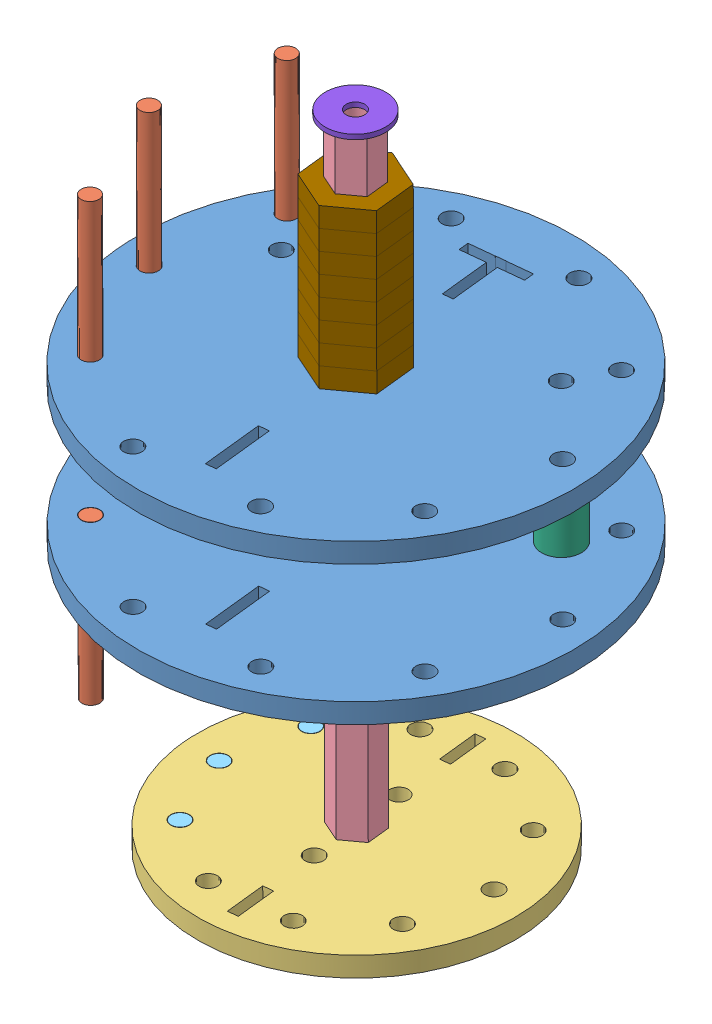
SolidWorks assembly Accumulator.SLDASM, configuration Default (file format 7000). Lengths in mm.
Overall size (76.79 111.93 76.84).
26 component instances, 9 part files, 36 mates.
Components (placement in the parent):
- AccumulatorGear-3: AccumulatorGear.SLDPRT [accum] at (5.3215 -39.4588 28.4724) x (0.104553 -0.002805 0.994515) z (-0.994519 0.00053 0.104555) size (69.85 3.17 69.85)
- AccumulatorGear-4: AccumulatorGear.SLDPRT [accum] at (5.3032 -61.6837 28.4116) x (0.104553 -0.002805 0.994515) z (-0.994519 0.00053 0.104555) size (69.85 3.17 69.85)
- Screw-4-40-1in-1: Screw-4-40-1in.SLDPRT [Default] at (-24.5385 -14.043 31.6833) x (0.998773 -0.000684 -0.049509) z (-0.049507 0.002771 -0.99877) size (2.84 25.4 2.84)
- Screw-4-40-1in-2: Screw-4-40-1in.SLDPRT [Default] at (-20.6782 -13.9965 13.5198) x (0.998773 -0.000684 -0.049509) z (-0.049507 0.002771 -0.99877) size (2.84 25.4 2.84)
- Screw-4-40-1in-3: Screw-4-40-1in.SLDPRT [Default] at (-16.9854 -14.0955 48.6468) x (0.998773 -0.000684 -0.049509) z (-0.049507 0.002771 -0.99877) size (2.84 25.4 2.84)
- Screw-4-40-1in-4: Screw-4-40-1in.SLDPRT [Default] at (-24.575 -58.4928 31.5617) x (0.998773 -0.000684 -0.049509) z (-0.049507 0.002771 -0.99877) size (2.84 25.4 2.84)
- Screw-4-40-1in-5: Screw-4-40-1in.SLDPRT [Default] at (-17.0427 -83.9452 48.4558) x (-0.902967 0.001916 -0.429705) z (0.429708 0.002116 -0.902965) size (2.84 25.4 2.84)
- Screw-4-40-1in-6: Screw-4-40-1in.SLDPRT [Default] at (-20.7147 -58.4463 13.3983) x (0.998773 -0.000684 -0.049509) z (-0.049507 0.002771 -0.99877) size (2.84 25.4 2.84)
- OutputGear-1: OutputGear.SLDPRT [Default] at (5.2689 -103.5935 28.297) x (0.104553 -0.002805 0.994515) z (-0.994519 0.00053 0.104555) size (50.8 3.17 50.8)
- Standoff-4in-1s4-2: Standoff-4in-1s4.SLDPRT [Default] at (5.2689 -103.5935 28.297) x (0.104553 -0.002805 0.994515) z (-0.994519 0.00053 0.104555) size (7.33 101.6 6.35)
- Screw-4-40-0p5in-1: Screw-4-40-0p5in.SLDPRT [Default] at (-14.6072 -113.1079 30.3598) x (1 -0.00082 -0.000001) z (-0.000001 -0.002734 0.999996) size (2.84 12.7 2.84)
- Screw-4-40-0p5in-2: Screw-4-40-0p5in.SLDPRT [Default] at (-9.585 -113.1428 41.6391) x (1 -0.00082 -0.000001) z (-0.000001 -0.002734 0.999996) size (2.84 12.7 2.84)
- Screw-4-40-0p5in-3: Screw-4-40-0p5in.SLDPRT [Default] at (-12.0405 -113.077 18.2826) x (1 -0.00082 -0.000001) z (-0.000001 -0.002734 0.999996) size (2.84 12.7 2.84)
- Standoff-p75in-1s4-1: Standoff-p75in-1s4.SLDPRT [Default] at (24.329 -39.4366 14.6619) x (1 -0.00082 -0.000001) z (-0.00082 -0.999996 -0.002734) size (6.35 6.35 19.05)
- Standoff-p75in-1s4-2: Standoff-p75in-1s4.SLDPRT [Default] at (-16.1425 -39.415 18.9167) x (0.984615 -0.00033 -0.174737) z (-0.00082 -0.999996 -0.002734) size (6.35 6.35 19.05)
- OutputGearCap-1: OutputGearCap.SLDPRT [Default] at (5.2663 -106.7685 28.2884) x (0.104553 -0.002805 0.994515) z (-0.994519 0.00053 0.104555) size (21.59 3.17 21.59)
- Washer-0p38in-1: Washer-0p38in.SLDPRT [Default] at (5.3522 -1.9939 28.5748) x (0.863042 0.000673 -0.505132) z (0.00082 0.999996 0.002734) size (9.65 9.65 0.76)
- Spacer-stack-8-1: Spacer-stack-8.SLDASM [Default] at (-3.9287 -43.7527 21.5045) x (0.104553 -0.002805 0.994515) z (0.00082 0.999996 0.002734) size (13.2 11.43 25.4)
  - Spacer-hex-1s4-1: Spacer-hex-1s4.SLDPRT [Default] at (7.8847 8.4687 7.4956) size (13.2 11.43 3.17)
  - Spacer-hex-1s4-2: Spacer-hex-1s4.SLDPRT [Default] at (7.8847 8.4687 10.6706) size (13.2 11.43 3.17)
  - Spacer-hex-1s4-3: Spacer-hex-1s4.SLDPRT [Default] at (7.8847 8.4687 13.8456) size (13.2 11.43 3.17)
  - Spacer-hex-1s4-4: Spacer-hex-1s4.SLDPRT [Default] at (7.8847 8.4687 17.0206) size (13.2 11.43 3.17)
  - Spacer-hex-1s4-5: Spacer-hex-1s4.SLDPRT [Default] at (7.8847 8.4687 20.1956) size (13.2 11.43 3.17)
  - Spacer-hex-1s4-6: Spacer-hex-1s4.SLDPRT [Default] at (7.8847 8.4687 23.3706) size (13.2 11.43 3.17)
  - Spacer-hex-1s4-7: Spacer-hex-1s4.SLDPRT [Default] at (7.8847 8.4687 26.5456) size (13.2 11.43 3.17)
  - Spacer-hex-1s4-8: Spacer-hex-1s4.SLDPRT [Default] at (7.8847 8.4687 29.7206) size (13.2 11.43 3.17)
Mates (geometry in assembly coordinates):
- Concentric16: concentric anti-aligned: circle of AccumulatorGear-3; circle of Screw-4-40-1in-1
- Coincident36: coincident aligned: plane of AccumulatorGear-3 through (5.3236 -36.9188 28.4793) normal (-0.00082 -0.999996 -0.002734); plane of Screw-4-40-1in-1 through (-24.5573 -36.9029 31.6207) normal (-0.00082 -0.999996 -0.002734)
- Concentric17: concentric anti-aligned: circle of AccumulatorGear-3; circle of Screw-4-40-1in-2
- Coincident37: coincident aligned: plane of AccumulatorGear-3 through (5.3236 -36.9188 28.4793) normal (-0.00082 -0.999996 -0.002734); plane of Screw-4-40-1in-2 through (-20.697 -36.8564 13.4573) normal (-0.00082 -0.999996 -0.002734)
- Concentric18: concentric anti-aligned: circle of AccumulatorGear-3; circle of Screw-4-40-1in-3
- Coincident38: coincident aligned: plane of AccumulatorGear-3 through (5.3236 -36.9188 28.4793) normal (-0.00082 -0.999996 -0.002734); plane of Screw-4-40-1in-3 through (-17.0041 -36.9554 48.5843) normal (-0.00082 -0.999996 -0.002734)
- Concentric19: concentric anti-aligned: circle of AccumulatorGear-4; circle of Screw-4-40-1in-4
- Coincident43: coincident aligned: plane of AccumulatorGear-4 through (5.3079 -55.9687 28.4273) normal (0.00082 0.999996 0.002734); plane of Screw-4-40-1in-4 through (-24.5729 -55.9528 31.5687) normal (0.00082 0.999996 0.002734)
- Concentric20: concentric aligned: circle of AccumulatorGear-4; circle of Screw-4-40-1in-5
- Coincident44: coincident aligned: plane of AccumulatorGear-4 through (5.3079 -55.9687 28.4273) normal (0.00082 0.999996 0.002734); plane of Screw-4-40-1in-5 through (-17.0197 -56.0054 48.5322) normal (0.00082 0.999996 0.002734)
- Concentric21: concentric anti-aligned: circle of AccumulatorGear-4; circle of Screw-4-40-1in-6
- Coincident45: coincident aligned: plane of AccumulatorGear-4 through (5.3079 -55.9687 28.4273) normal (0.00082 0.999996 0.002734); plane of Screw-4-40-1in-6 through (-20.7126 -55.9063 13.4052) normal (0.00082 0.999996 0.002734)
- Coincident55: coincident aligned: line of OutputGear-1 through (5.6522 -103.6038 31.9431) axis (0.809002 0.000943 -0.587805); line of Standoff-4in-1s4-2 through (5.6522 -103.6038 31.9431) axis (0.809002 0.000943 -0.587805)
- Coincident56: coincident aligned: line of OutputGear-1 through (8.6181 -103.6003 29.7881) axis (-0.104553 0.002805 -0.994515); line of Standoff-4in-1s4-2 through (8.6181 -103.6003 29.7881) axis (-0.104553 0.002805 -0.994515)
- Concentric22: concentric aligned: circle of OutputGear-1; circle of Screw-4-40-0p5in-1
- Coincident57: coincident aligned: plane of OutputGear-1 through (5.2715 -100.4185 28.3057) normal (0.00082 0.999996 0.002734); plane of Screw-4-40-0p5in-1 through (-14.5968 -100.4079 30.3945) normal (0.00082 0.999996 0.002734)
- Concentric23: concentric aligned: circle of OutputGear-1; circle of Screw-4-40-0p5in-2
- Coincident58: coincident aligned: plane of OutputGear-1 through (5.2715 -100.4185 28.3057) normal (0.00082 0.999996 0.002734); plane of Screw-4-40-0p5in-2 through (-9.5746 -100.4429 41.6738) normal (0.00082 0.999996 0.002734)
- Concentric24: concentric aligned: circle of OutputGear-1; circle of Screw-4-40-0p5in-3
- Coincident59: coincident aligned: plane of OutputGear-1 through (5.2715 -100.4185 28.3057) normal (0.00082 0.999996 0.002734); circle of Screw-4-40-0p5in-3
- Coincident60: coincident anti-aligned: plane of AccumulatorGear-4 through (5.6912 -55.979 32.0733) normal (-0.587805 0.002694 -0.808998); plane of Standoff-4in-1s4-2 through (5.7355 -2.0042 32.2209) normal (0.587805 -0.002694 0.808998)
- Coincident61: coincident anti-aligned: plane of AccumulatorGear-4 through (2.342 -55.9722 30.5823) normal (0.406714 0.002164 -0.913553); plane of Standoff-4in-1s4-2 through (2.3863 -1.9974 30.7298) normal (-0.406714 -0.002164 0.913553)
- Coincident62: coincident anti-aligned: plane of AccumulatorGear-3 through (4.9429 -33.7335 24.842) normal (0.587805 -0.002694 0.808998); plane of Standoff-4in-1s4-2 through (4.9689 -1.9836 24.9288) normal (-0.587805 0.002694 -0.808998)
- Coincident63: coincident anti-aligned: plane of AccumulatorGear-3 through (8.2921 -33.7403 26.333) normal (-0.406714 -0.002164 0.913553); plane of Standoff-4in-1s4-2 through (8.3182 -1.9905 26.4198) normal (0.406714 0.002164 -0.913553)
- Coincident67: coincident anti-aligned: plane of AccumulatorGear-3 through (5.3236 -36.9188 28.4793) normal (-0.00082 -0.999996 -0.002734); plane of Standoff-p75in-1s4-2 through (-16.1404 -36.875 18.9237) normal (0.00082 0.999996 0.002734)
- Concentric25: concentric aligned: circle of Standoff-4in-1s4-2; circle of OutputGearCap-1
- Coincident68: coincident aligned: circle of OutputGear-1; circle of OutputGearCap-1
- Coincident69: coincident anti-aligned: circle of AccumulatorGear-3; circle of Standoff-p75in-1s4-2
- Coincident70: coincident anti-aligned: circle of AccumulatorGear-3; circle of Standoff-p75in-1s4-1
- Concentric26: concentric aligned: circle of Standoff-4in-1s4-2; circle of Washer-0p38in-1
- Coincident71: coincident anti-aligned: plane of Standoff-4in-1s4-2 through (5.3522 -1.9939 28.5748) normal (0.00082 0.999996 0.002734); plane of Washer-0p38in-1 through (5.3522 -1.9939 28.5748) normal (-0.00082 -0.999996 -0.002734)
- Coincident84: coincident anti-aligned: plane of Standoff-4in-1s4-2 through (4.9689 -1.9836 24.9288) normal (-0.587805 0.002694 -0.808998); plane of Spacer-stack-8-1/Spacer-hex-1s4-1 through (4.9455 -30.5585 24.8506) normal (0.587805 -0.002694 0.808998)
- Coincident85: coincident anti-aligned: plane of Standoff-4in-1s4-2 through (8.3182 -1.9905 26.4198) normal (0.406714 0.002164 -0.913553); plane of Spacer-stack-8-1/Spacer-hex-1s4-1 through (8.2947 -30.5654 26.3417) normal (-0.406714 -0.002164 0.913553)
- Coincident87: coincident anti-aligned: plane of AccumulatorGear-4 through (5.3079 -55.9687 28.4273) normal (0.00082 0.999996 0.002734); plane of Standoff-p75in-1s4-2 through (-16.156 -55.925 18.8716) normal (-0.00082 -0.999996 -0.002734)
- Coincident89: coincident anti-aligned: plane of AccumulatorGear-3 through (5.3262 -33.7438 28.488) normal (0.00082 0.999996 0.002734); plane of Spacer-stack-8-1/Spacer-hex-1s4-1 through (5.3262 -33.7438 28.488) normal (-0.00082 -0.999996 -0.002734)
- Distance1: distance = 8.89 mm anti-aligned: plane of Washer-0p38in-1 through (5.3522 -1.9939 28.5748) normal (-0.00082 -0.999996 -0.002734); plane of Spacer-stack-8-1/Spacer-hex-1s4-8 through (5.3449 -10.8839 28.5505) normal (0.00082 0.999996 0.002734)
